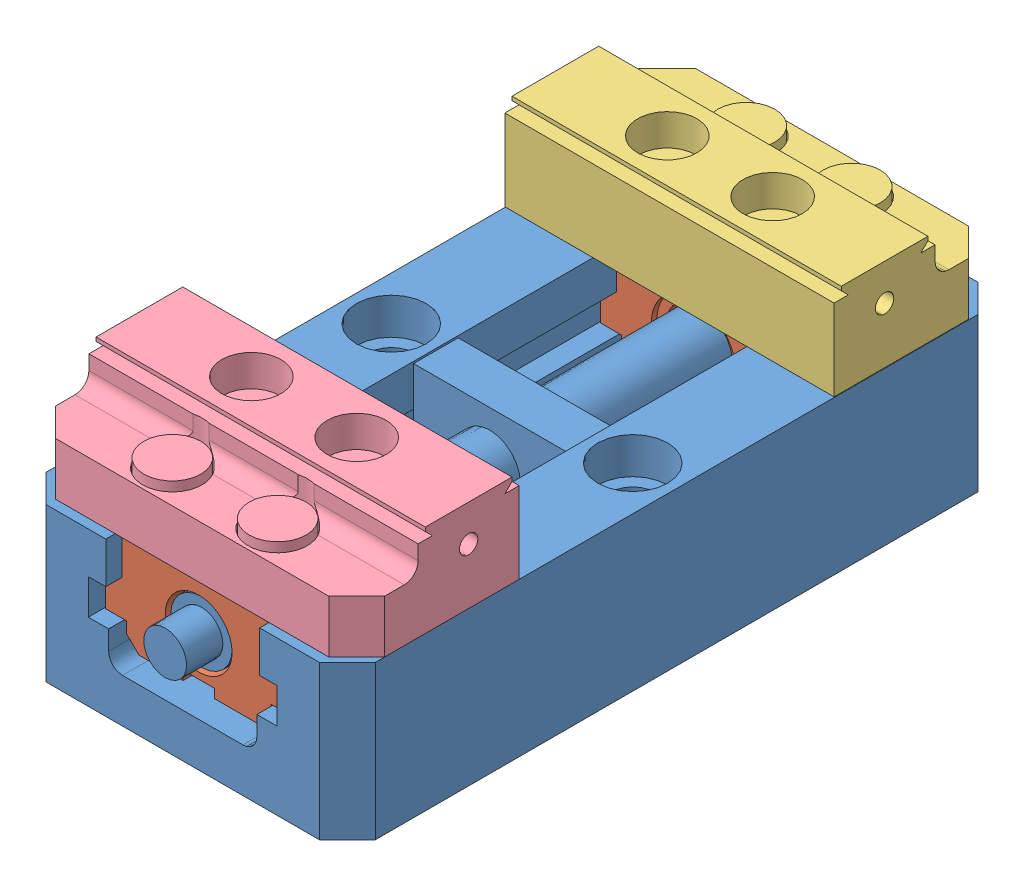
SolidWorks assembly D_V75150X.SLDASM, configuration Default (file format 15000). Lengths in mm.
Overall size (75 56.13 158).
5 component instances, 4 part files, 12 mates.
Components (placement in the parent):
- D_V75150X-1-1: D_V75150X-1.SLDPRT [Default] at (63.1124 81.9918 123.3615) size (75 35 158)
- D_V75100X-2-1: D_V75100X-2.SLDPRT [Default] at (63.1124 81.9918 66.9885) x (-1 0 0) z (0 0 -1) size (42.5 30.86 30)
- D_V75100X-2-2: D_V75100X-2.SLDPRT [Default] at (63.1124 81.9918 179.7345) size (42.5 30.86 30)
- D_V75100X-5L-1: D_V75100X-5L.SLDPRT [Default] at (63.1124 93.8028 87.4885) x (0 0 -1) z (1 0 0) size (37 21 75)
- D_V75100X-5V1-1: D_V75100X-5V1.SLDPRT [Default] at (63.1124 93.6758 159.2345) x (0 0 1) z (-1 0 0) size (37 21 75)
Mates (geometry in assembly coordinates):
- Concentric1: concentric aligned: cylinder of D_V75100X-2-2 through (63.1124 101.8028 179.7345) axis (0 -1 0) radius 2.5; cylinder of D_V75100X-5V1-1 through (63.1124 101.9135 179.7345) axis (0 -1 0) radius 2.526
- Coincident3: coincident anti-aligned: plane of D_V75150X-1-1 through (80.6384 93.6758 198.3615) normal (0 1 0); plane of D_V75100X-5V1-1 through (25.6124 93.6758 159.2345) normal (0 -1 0)
- Coincident5: coincident aligned: plane of D_V75150X-1-1 through (100.6124 58.6746 198.3615) normal (1 0 0); plane of D_V75100X-5V1-1 through (100.6124 108.8508 185.4095) normal (1 0 0)
- Coincident7: coincident anti-aligned: plane of D_V75100X-2-2 through (63.1124 93.8028 179.7345) normal (0 1 0); plane of D_V75100X-5L-1 through (100.6124 93.8028 87.4885) normal (0 -1 0)
- Parallel3: parallel aligned: plane of D_V75100X-2-2 through (63.1124 81.9918 194.7345) normal (0 0 1); plane of D_V75100X-5V1-1 through (25.6124 93.6758 196.2345) normal (0 0 1)
- Concentric2: concentric aligned: cylinder of D_V75100X-2-1 through (63.1124 101.8028 66.9885) axis (0 -1 0) radius 2.5; cylinder of D_V75100X-5L-1 through (63.1124 102.0405 66.9885) axis (0 -1 0) radius 2.526
- Parallel4: parallel aligned: plane of D_V75100X-2-1 through (63.1124 81.9918 51.9885) normal (0 0 -1); plane of D_V75100X-5L-1 through (100.6124 93.8028 50.4885) normal (0 0 -1)
- Coincident10: coincident anti-aligned: plane of D_V75100X-2-1 through (63.1124 93.8028 66.9885) normal (0 1 0); plane of D_V75100X-5L-1 through (100.6124 93.8028 87.4885) normal (0 -1 0)
- Distance2: distance = 37.5 mm: plane of assembly through (0 0 123.3615) normal (0 0 1); plane of assembly; plane of D_V75100X-5V1-1 through (25.6124 114.6758 160.8615) normal (0 0 -1)
- Distance3: distance = 37.5 mm: plane of assembly through (0 0 123.3615) normal (0 0 1); plane of assembly; plane of D_V75100X-5L-1 through (100.6124 114.8028 85.8615) normal (0 0 1)
- Concentric3: concentric aligned: cylinder of D_V75150X-1-1 through (63.1124 81.9918 52.6165) axis (0 0 -1) radius 4.8895; cylinder of D_V75100X-2-1 through (63.1124 81.9918 59.5973) axis (0 0 -1) radius 7.62
- Coincident12: coincident aligned: plane of D_V75150X-1-1 through (100.6124 58.6746 198.3615) normal (1 0 0); plane of D_V75100X-5L-1 through (100.6124 108.9778 61.3135) normal (1 0 0)
